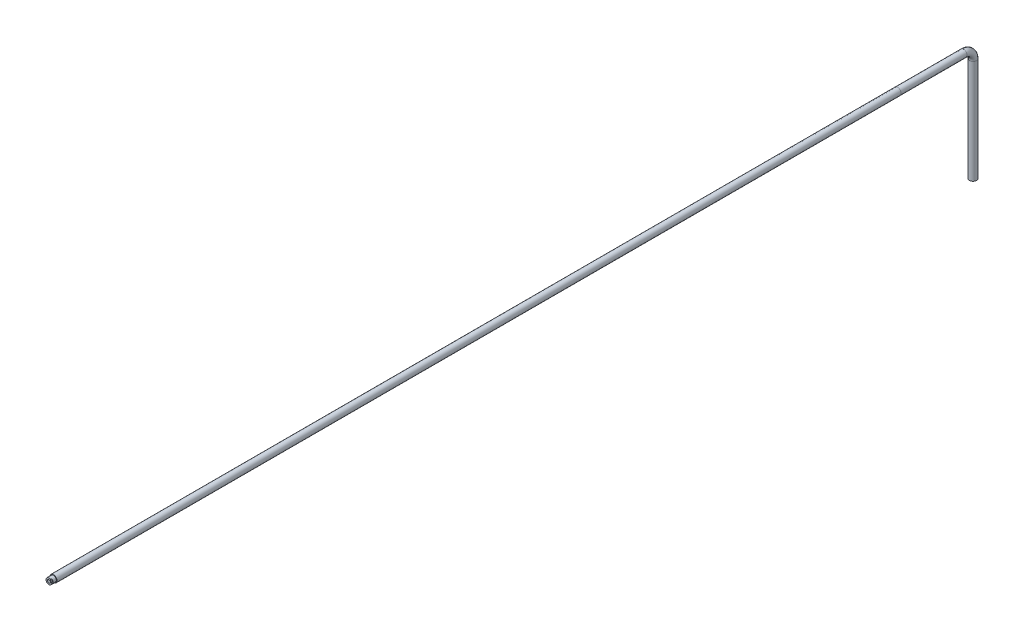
from build123d import *

# Parameters (mm, degrees)
SKETCH2_R                 = 2.38125
F_3_48_TAPPED_HOLE1_D     = 1.9939
F_3_48_TAPPED_HOLE1_DEPTH = 7.6708
F_3_48_TAPPED_HOLE1_TIP   = 0.599027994
SKETCH7_OUTSIDE_W         = 132.686
SKETCH7_OUTSIDE_H         = 206.505
SKETCH7_OUTSIDE_R         = 1.9685
CUT_EXTRUDE2_DEPTH        = 3.048
CUT_EXTRUDE3_DEPTH        = 0.79248
SKETCH9_OUTSIDE_W         = 132.686
SKETCH9_OUTSIDE_H         = 206.505
SKETCH9_OUTSIDE_R         = 2.3495
CUT_EXTRUDE4_DEPTH        = 44.45


with BuildPart() as part:
    # Sweep1: sweep along a path in PATH
    with BuildLine(Plane(origin=(0, 0, 0), x_dir=(0, 0, -1), z_dir=(1, 0, 0))) as sweep1_path:
        Line((0, 0), (615.95, 0))
        ThreePointArc((615.95, 0), (620.440128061, -1.859871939), (622.3, -6.35))
        Line((622.3, -6.35), (622.3, -76.2))
    # Sketch2 → Sweep1 (sweep)
    with BuildSketch(Plane.XY):
        Circle(SKETCH2_R)
    sweep(path=sweep1_path.line)

    # 3-48 Tapped Hole1
    with Locations(Plane.XY):
        with Locations((0, 0)):
            Hole(F_3_48_TAPPED_HOLE1_D / 2, depth=F_3_48_TAPPED_HOLE1_DEPTH)
            with Locations((0, 0, -(F_3_48_TAPPED_HOLE1_DEPTH + F_3_48_TAPPED_HOLE1_TIP / 2))):  # 118° drill point
                Cone(0, F_3_48_TAPPED_HOLE1_D / 2, F_3_48_TAPPED_HOLE1_TIP, mode=Mode.SUBTRACT)

    # Sketch7 outside → Cut-Extrude2 (cut)
    with BuildSketch(Plane.XY):
        with Locations((0, -36.9095)):
            Rectangle(SKETCH7_OUTSIDE_W, SKETCH7_OUTSIDE_H)
        Circle(SKETCH7_OUTSIDE_R, mode=Mode.SUBTRACT)
    extrude(amount=-CUT_EXTRUDE2_DEPTH, mode=Mode.SUBTRACT)

    # Sketch8 → Cut-Extrude3 (cut)
    with BuildSketch(Plane.XY):
        Polygon((0.430891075, 3.036584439), (2.517915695, -1.850891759), (2.787872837, -1.174689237), (1.158605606, 2.795746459), align=None)
    extrude(amount=-CUT_EXTRUDE3_DEPTH, mode=Mode.SUBTRACT)

    # Sketch9 outside → Cut-Extrude4 (cut)
    with BuildSketch(Plane.XY.offset(-571.5)):
        with Locations((0, -36.9095)):
            Rectangle(SKETCH9_OUTSIDE_W, SKETCH9_OUTSIDE_H)
        Circle(SKETCH9_OUTSIDE_R, mode=Mode.SUBTRACT)
    extrude(amount=-CUT_EXTRUDE4_DEPTH, mode=Mode.SUBTRACT)


solid = part.part
